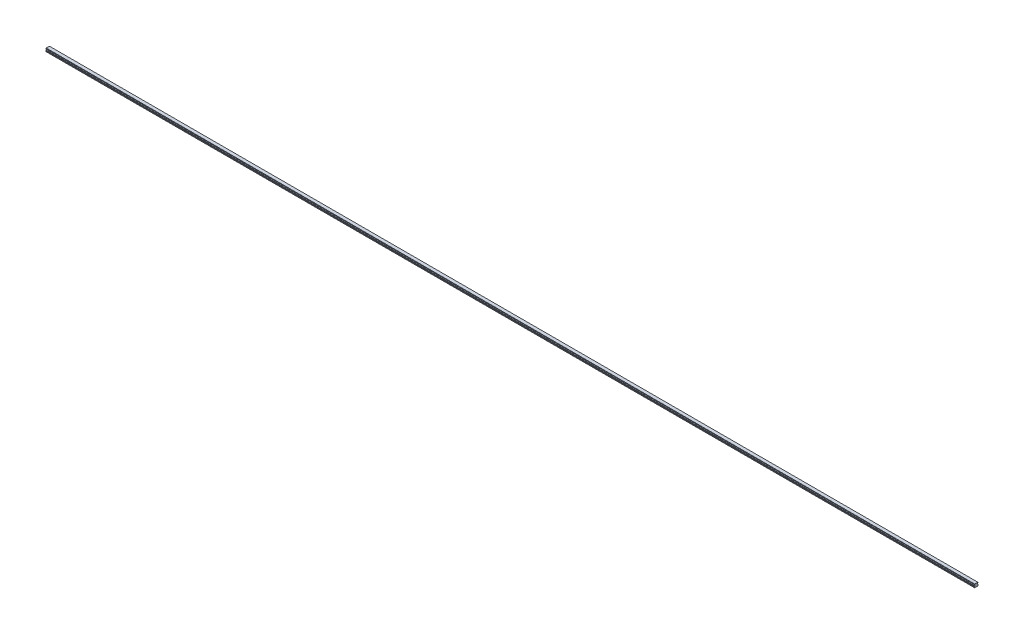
from build123d import *

# Parameters (mm, degrees)
BOSS_EXTRUDE1_DEPTH        = 3840
SKETCH3_R                  = 2.5
SKETCH3_R_2                = 2.1
CUT_EXTRUDE3_DEPTH         = 7
SKETCH3_2_R                = 2.1
CUT_EXTRUDE4_DEPTH         = 9.5
CHAMFER1_SIZE              = 0.4
LPATTERN2_COUNT            = 64
LPATTERN2_PITCH            = 60
CHAMFER1_OF_LPATTERN2_SIZE = 0.4


with BuildPart() as part:
    # Sketch1 → Boss-Extrude1 (new body)
    with BuildSketch(Plane(origin=(0, 0, 0), x_dir=(0, 0, -1), z_dir=(1, 0, 0))):
        with BuildLine():
            Line((6.59, 14), (-6.59, 14))
            Line((-6.59, 14), (-6.59, 13.15))
            Line((-6.59, 13.15), (-6.96, 12.356532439))
            Line((-6.96, 12.356532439), (-6.96, 11.435174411))
            ThreePointArc((-6.96, 11.435174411), (-5.25, 9.5), (-6.96, 7.564825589))
            Line((-6.96, 7.564825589), (-6.96, 6.643467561))
            Line((-6.96, 6.643467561), (-6.59, 5.85))
            Line((-6.59, 5.85), (-7.032116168, 4.2))
            Line((-7.032116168, 4.2), (-7.5, 3.929867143))
            Line((-7.5, 3.929867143), (-7.5, 1.4))
            Line((-7.5, 1.4), (-6.1, 0))
            Line((-6.1, 0), (-3.65, 0))
            Line((-3.65, 0), (-3.25, 0.4))
            Line((-3.25, 0.4), (3.25, 0.4))
            Line((3.25, 0.4), (3.65, 0))
            Line((3.65, 0), (6.1, 0))
            Line((6.1, 0), (7.5, 1.4))
            Line((7.5, 1.4), (7.5, 3.929867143))
            Line((7.5, 3.929867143), (7.032116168, 4.2))
            Line((7.032116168, 4.2), (6.59, 5.85))
            Line((6.59, 5.85), (6.96, 6.643467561))
            Line((6.96, 6.643467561), (6.96, 7.564825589))
            ThreePointArc((6.96, 7.564825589), (5.25, 9.5), (6.96, 11.435174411))
            Line((6.96, 11.435174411), (6.96, 12.356532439))
            Line((6.96, 12.356532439), (6.59, 13.15))
            Line((6.59, 13.15), (6.59, 14))
        make_face()
    extrude(amount=BOSS_EXTRUDE1_DEPTH)

    # Sketch3 → Cut-Extrude3 (cut)
    with BuildSketch(Plane.XZ):
        with Locations(Location((30, 0, 0), (0, 0, 270))):
            Circle(SKETCH3_R)
        with Locations(Location((30, 0, 0), (0, 0, 270))):
            Circle(SKETCH3_R_2, mode=Mode.SUBTRACT)
    cut_extrude3 = extrude(amount=-CUT_EXTRUDE3_DEPTH, mode=Mode.SUBTRACT)

    # Sketch3_2 → Cut-Extrude4 (cut)
    with BuildSketch(Plane.XZ):
        with Locations(Location((30, 0, 0), (0, 0, 270))):
            Circle(SKETCH3_2_R)
    cut_extrude4 = extrude(amount=-CUT_EXTRUDE4_DEPTH, mode=Mode.SUBTRACT)

    # Cut-Extrude5 cone 1 section (on through the dimple's axis) → Cut-Extrude5 (revolve, cut)
    with BuildSketch(Plane(origin=(30, 9.5, 0), x_dir=(0, 0, -1), z_dir=(1, 0, 0))):
        Polygon((0, 0), (2.1, 0), (0, 1.212435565), align=None)
    revolve(axis=Axis((30, 9.5, 0), (0, 1, 0)), mode=Mode.SUBTRACT)

    # Chamfer1
    chamfer1_edges = [part.edges().sort_by_distance(p)[0] for p in [
        (30, 0.4, 2.5),
    ]]
    chamfer(chamfer1_edges, length=CHAMFER1_SIZE)

    # LPattern2: Cut-Extrude3, Cut-Extrude4 ×64
    with Locations(*[(i * LPATTERN2_PITCH, 0, 0) for i in range(1, LPATTERN2_COUNT)]):
        add(cut_extrude3, mode=Mode.SUBTRACT)
        add(cut_extrude4, mode=Mode.SUBTRACT)

    # Chamfer1 of LPattern2
    chamfer1_of_lpattern2_edges = [part.edges().sort_by_distance(p)[0] for p in [
        (90, 0.4, 2.5),
        (150, 0.4, 2.5),
        (210, 0.4, 2.5),
        (270, 0.4, 2.5),
        (330, 0.4, 2.5),
        (390, 0.4, 2.5),
        (450, 0.4, 2.5),
        (510, 0.4, 2.5),
        (570, 0.4, 2.5),
        (630, 0.4, 2.5),
        (690, 0.4, 2.5),
        (750, 0.4, 2.5),
        (810, 0.4, 2.5),
        (870, 0.4, 2.5),
        (930, 0.4, 2.5),
        (990, 0.4, 2.5),
        (1050, 0.4, 2.5),
        (1110, 0.4, 2.5),
        (1170, 0.4, 2.5),
        (1230, 0.4, 2.5),
        (1290, 0.4, 2.5),
        (1350, 0.4, 2.5),
        (1410, 0.4, 2.5),
        (1470, 0.4, 2.5),
        (1530, 0.4, 2.5),
        (1590, 0.4, 2.5),
        (1650, 0.4, 2.5),
        (1710, 0.4, 2.5),
        (1770, 0.4, 2.5),
        (1830, 0.4, 2.5),
        (1890, 0.4, 2.5),
        (1950, 0.4, 2.5),
        (2010, 0.4, 2.5),
        (2070, 0.4, 2.5),
        (2130, 0.4, 2.5),
        (2190, 0.4, 2.5),
        (2250, 0.4, 2.5),
        (2310, 0.4, 2.5),
        (2370, 0.4, 2.5),
        (2430, 0.4, 2.5),
        (2490, 0.4, 2.5),
        (2550, 0.4, 2.5),
        (2610, 0.4, 2.5),
        (2670, 0.4, 2.5),
        (2730, 0.4, 2.5),
        (2790, 0.4, 2.5),
        (2850, 0.4, 2.5),
        (2910, 0.4, 2.5),
        (2970, 0.4, 2.5),
        (3030, 0.4, 2.5),
        (3090, 0.4, 2.5),
        (3150, 0.4, 2.5),
        (3210, 0.4, 2.5),
        (3270, 0.4, 2.5),
        (3330, 0.4, 2.5),
        (3390, 0.4, 2.5),
        (3450, 0.4, 2.5),
        (3510, 0.4, 2.5),
        (3570, 0.4, 2.5),
        (3630, 0.4, 2.5),
        (3690, 0.4, 2.5),
        (3750, 0.4, 2.5),
        (3810, 0.4, 2.5),
    ]]
    chamfer(chamfer1_of_lpattern2_edges, length=CHAMFER1_OF_LPATTERN2_SIZE)


solid = part.part
